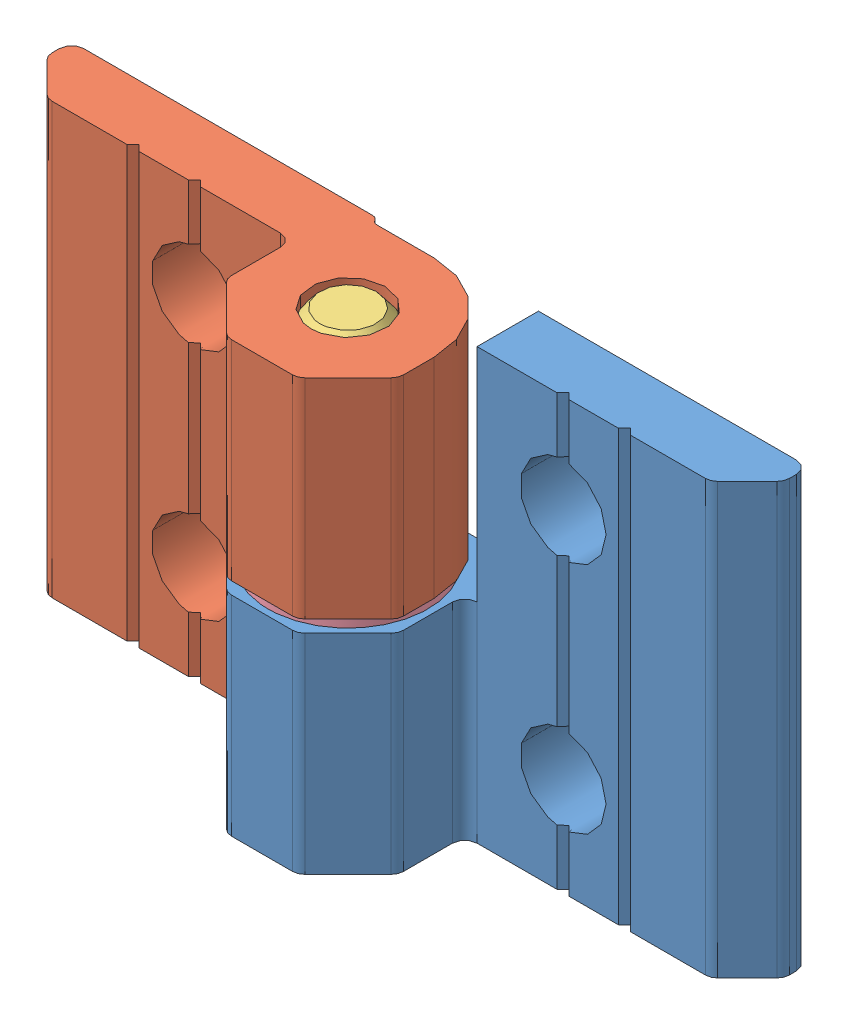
SolidWorks assembly J3HR.SLDASM, configuration Default (file format 7000). Lengths in mm.
Overall size (60 35 14.5).
4 component instances, 4 part files, 7 mates.
Components (placement in the parent):
- J3HR-2-1: J3HR-2.SLDPRT [Default] at origin size (37 35 14.5)
- J3HR-1-1: J3HR-1.SLDPRT [Default] at origin size (37 35 14.5)
- J3HR-3-1: J3HR-3.SLDPRT [Default] at origin size (6.3 35 6.3)
- J3HR-4-1: J3HR-4.SLDPRT [Default] at (0 17 0) size (13 1 13)
Mates (geometry in assembly coordinates):
- 一致1: coincident aligned: plane of J3HR-2-1 through (29 0 -5.9142) normal (0 -1 0); plane of J3HR-3-1 through (0 0 0) normal (0 -1 0)
- 一致2: coincident aligned: plane of J3HR-3-1 through (0 35 0) normal (0 1 0); plane of J3HR-1-1 through (-29 35 -5.9142) normal (0 1 0)
- 角度2: planar angle aligned: plane of J3HR-1-1 through (-26.5858 35 -2.5) normal (0 0 1); plane of J3HR-2-1 through (26.5858 35 -2.5) normal (0 0 1)
- 一致6: coincident anti-aligned: plane of J3HR-2-1 through (8 17 27.5) normal (0 1 0); plane of J3HR-4-1 through (0 17 0) normal (0 -1 0)
- 同心円1: concentric aligned: cylinder of J3HR-2-1 through (0 35 0) axis (0 -1 0) radius 3; cylinder of J3HR-4-1 through (0 18 0) axis (0 -1 0) radius 3
- 同心円2: concentric anti-aligned: cylinder of J3HR-2-1 through (0 35 0) axis (0 -1 0) radius 3; cone of J3HR-3-1 through (0 0 0) axis (0 1 0)
- 同心円3: concentric anti-aligned: cylinder of J3HR-1-1 through (0 35 0) axis (0 -1 0) radius 3; cone of J3HR-3-1 through (0 0 0) axis (0 1 0)
